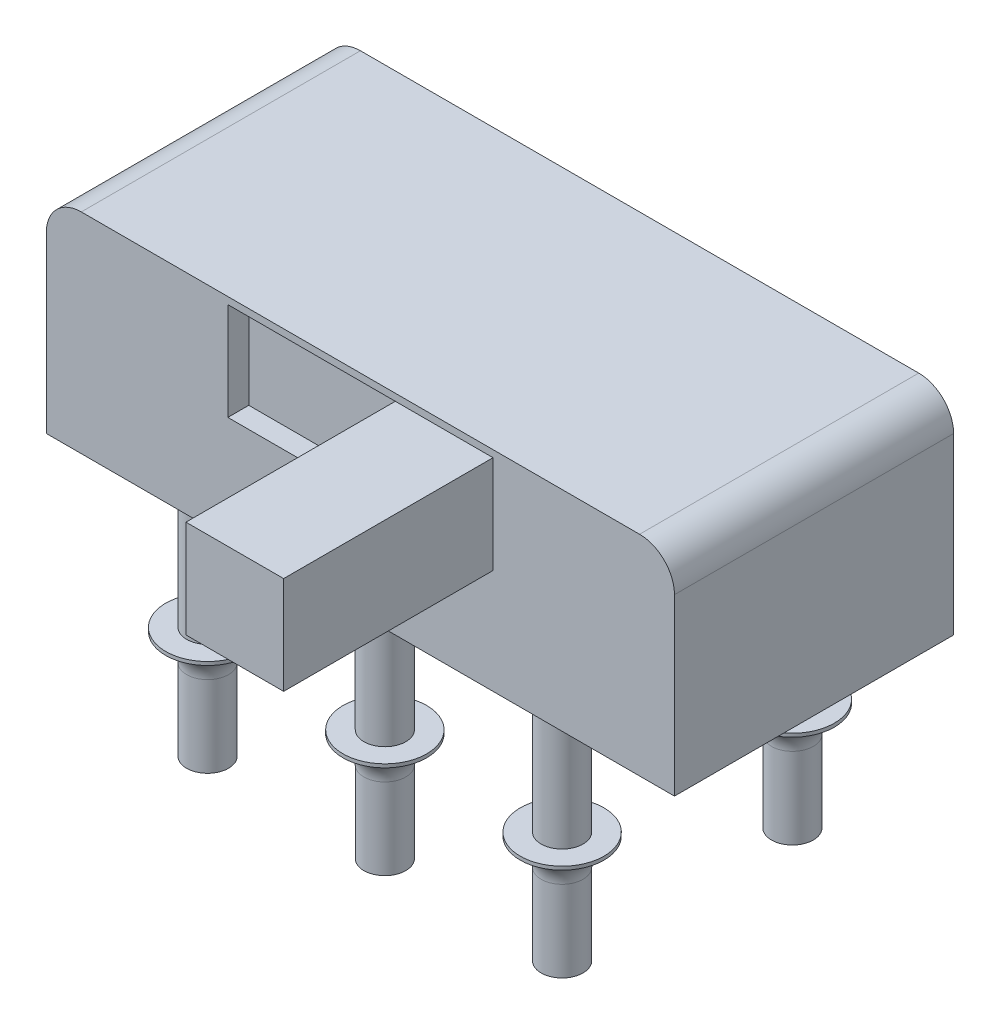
ISO-10303-21;
HEADER;
FILE_DESCRIPTION(('STEP AP214'),'2;1');
FILE_NAME('part.step','',(''),(''),'','','');
FILE_SCHEMA(('AUTOMOTIVE_DESIGN { 1 0 10303 214 1 1 1 1 }'));
ENDSEC;
DATA;
#1=APPLICATION_CONTEXT('core data for automotive mechanical design processes');
#2=APPLICATION_PROTOCOL_DEFINITION('international standard','automotive_design',2000,#1);
#3=PRODUCT_CONTEXT('',#1,'mechanical');
#4=PRODUCT('Part','Part','',(#3));
#5=PRODUCT_RELATED_PRODUCT_CATEGORY('part','',(#4));
#6=PRODUCT_DEFINITION_FORMATION('','',#4);
#7=PRODUCT_DEFINITION_CONTEXT('part definition',#1,'design');
#8=PRODUCT_DEFINITION('design','',#6,#7);
#9=PRODUCT_DEFINITION_SHAPE('','',#8);
#10=(LENGTH_UNIT() NAMED_UNIT(*) SI_UNIT(.MILLI.,.METRE.));
#11=(NAMED_UNIT(*) PLANE_ANGLE_UNIT() SI_UNIT($,.RADIAN.));
#12=(NAMED_UNIT(*) SI_UNIT($,.STERADIAN.) SOLID_ANGLE_UNIT());
#13=UNCERTAINTY_MEASURE_WITH_UNIT(LENGTH_MEASURE(1.E-05),#10,'distance_accuracy_value','');
#14=(GEOMETRIC_REPRESENTATION_CONTEXT(3) GLOBAL_UNCERTAINTY_ASSIGNED_CONTEXT((#13)) GLOBAL_UNIT_ASSIGNED_CONTEXT((#10,
#11,#12)) REPRESENTATION_CONTEXT('',''));
#15=CARTESIAN_POINT('',(0.,0.,0.));
#16=DIRECTION('',(0.,0.,1.));
#17=DIRECTION('',(1.,0.,0.));
#18=AXIS2_PLACEMENT_3D('',#15,#16,#17);
#19=CARTESIAN_POINT('',(2.54,-3.2,1.65));
#20=DIRECTION('',(0.,1.,0.));
#21=DIRECTION('',(0.,0.,1.));
#22=AXIS2_PLACEMENT_3D('',#19,#20,#21);
#23=CYLINDRICAL_SURFACE('',#22,0.3);
#24=CARTESIAN_POINT('',(2.54,0.,1.65));
#25=DIRECTION('',(0.,-1.,0.));
#26=DIRECTION('',(0.,0.,-1.));
#27=AXIS2_PLACEMENT_3D('',#24,#25,#26);
#28=CIRCLE('',#27,0.3);
#29=CARTESIAN_POINT('',(2.54,0.,1.35));
#30=VERTEX_POINT('',#29);
#31=EDGE_CURVE('E349',#30,#30,#28,.T.);
#32=ORIENTED_EDGE('',*,*,#31,.T.);
#33=EDGE_LOOP('',(#32));
#34=FACE_BOUND('',#33,.T.);
#35=CARTESIAN_POINT('',(2.54,-1.6,1.65));
#36=DIRECTION('',(0.,-1.,0.));
#37=DIRECTION('',(0.,0.,-1.));
#38=AXIS2_PLACEMENT_3D('',#35,#36,#37);
#39=CIRCLE('',#38,0.3);
#40=CARTESIAN_POINT('',(2.54,-1.6,1.35));
#41=VERTEX_POINT('',#40);
#42=EDGE_CURVE('E248',#41,#41,#39,.T.);
#43=ORIENTED_EDGE('',*,*,#42,.F.);
#44=EDGE_LOOP('',(#43));
#45=FACE_BOUND('',#44,.T.);
#46=ADVANCED_FACE('F35',(#34,#45),#23,.T.);
#47=CARTESIAN_POINT('',(2.54,-3.2,-1.65));
#48=DIRECTION('',(0.,1.,0.));
#49=DIRECTION('',(0.,0.,1.));
#50=AXIS2_PLACEMENT_3D('',#47,#48,#49);
#51=CYLINDRICAL_SURFACE('',#50,0.3);
#52=CARTESIAN_POINT('',(2.54,0.,-1.65));
#53=DIRECTION('',(0.,-1.,0.));
#54=DIRECTION('',(0.,0.,-1.));
#55=AXIS2_PLACEMENT_3D('',#52,#53,#54);
#56=CIRCLE('',#55,0.3);
#57=CARTESIAN_POINT('',(2.54,0.,-1.95));
#58=VERTEX_POINT('',#57);
#59=EDGE_CURVE('E348',#58,#58,#56,.T.);
#60=ORIENTED_EDGE('',*,*,#59,.T.);
#61=EDGE_LOOP('',(#60));
#62=FACE_BOUND('',#61,.T.);
#63=CARTESIAN_POINT('',(2.54,-1.6,-1.65));
#64=DIRECTION('',(0.,-1.,0.));
#65=DIRECTION('',(0.,0.,-1.));
#66=AXIS2_PLACEMENT_3D('',#63,#64,#65);
#67=CIRCLE('',#66,0.3);
#68=CARTESIAN_POINT('',(2.54,-1.6,-1.95));
#69=VERTEX_POINT('',#68);
#70=EDGE_CURVE('E245',#69,#69,#67,.T.);
#71=ORIENTED_EDGE('',*,*,#70,.F.);
#72=EDGE_LOOP('',(#71));
#73=FACE_BOUND('',#72,.T.);
#74=ADVANCED_FACE('F315',(#62,#73),#51,.T.);
#75=CARTESIAN_POINT('',(0.,-3.2,1.65));
#76=DIRECTION('',(0.,1.,0.));
#77=DIRECTION('',(0.,0.,1.));
#78=AXIS2_PLACEMENT_3D('',#75,#76,#77);
#79=CYLINDRICAL_SURFACE('',#78,0.3);
#80=CARTESIAN_POINT('',(0.,0.,1.65));
#81=DIRECTION('',(0.,-1.,0.));
#82=DIRECTION('',(0.,0.,-1.));
#83=AXIS2_PLACEMENT_3D('',#80,#81,#82);
#84=CIRCLE('',#83,0.3);
#85=CARTESIAN_POINT('',(0.,0.,1.35));
#86=VERTEX_POINT('',#85);
#87=EDGE_CURVE('E361',#86,#86,#84,.T.);
#88=ORIENTED_EDGE('',*,*,#87,.T.);
#89=EDGE_LOOP('',(#88));
#90=FACE_BOUND('',#89,.T.);
#91=CARTESIAN_POINT('',(0.,-1.6,1.65));
#92=DIRECTION('',(0.,-1.,0.));
#93=DIRECTION('',(0.,0.,-1.));
#94=AXIS2_PLACEMENT_3D('',#91,#92,#93);
#95=CIRCLE('',#94,0.3);
#96=CARTESIAN_POINT('',(0.,-1.6,1.35));
#97=VERTEX_POINT('',#96);
#98=EDGE_CURVE('E242',#97,#97,#95,.T.);
#99=ORIENTED_EDGE('',*,*,#98,.F.);
#100=EDGE_LOOP('',(#99));
#101=FACE_BOUND('',#100,.T.);
#102=ADVANCED_FACE('F322',(#90,#101),#79,.T.);
#103=CARTESIAN_POINT('',(0.,-3.2,-1.65));
#104=DIRECTION('',(0.,1.,0.));
#105=DIRECTION('',(0.,0.,1.));
#106=AXIS2_PLACEMENT_3D('',#103,#104,#105);
#107=CYLINDRICAL_SURFACE('',#106,0.3);
#108=CARTESIAN_POINT('',(0.,0.,-1.65));
#109=DIRECTION('',(0.,-1.,0.));
#110=DIRECTION('',(0.,0.,-1.));
#111=AXIS2_PLACEMENT_3D('',#108,#109,#110);
#112=CIRCLE('',#111,0.3);
#113=CARTESIAN_POINT('',(0.,0.,-1.95));
#114=VERTEX_POINT('',#113);
#115=EDGE_CURVE('E366',#114,#114,#112,.T.);
#116=ORIENTED_EDGE('',*,*,#115,.T.);
#117=EDGE_LOOP('',(#116));
#118=FACE_BOUND('',#117,.T.);
#119=CARTESIAN_POINT('',(0.,-1.6,-1.65));
#120=DIRECTION('',(0.,-1.,0.));
#121=DIRECTION('',(0.,0.,-1.));
#122=AXIS2_PLACEMENT_3D('',#119,#120,#121);
#123=CIRCLE('',#122,0.3);
#124=CARTESIAN_POINT('',(0.,-1.6,-1.95));
#125=VERTEX_POINT('',#124);
#126=EDGE_CURVE('E239',#125,#125,#123,.T.);
#127=ORIENTED_EDGE('',*,*,#126,.F.);
#128=EDGE_LOOP('',(#127));
#129=FACE_BOUND('',#128,.T.);
#130=ADVANCED_FACE('F403',(#118,#129),#107,.T.);
#131=CARTESIAN_POINT('',(-2.54,-3.2,1.65));
#132=DIRECTION('',(0.,1.,0.));
#133=DIRECTION('',(0.,0.,1.));
#134=AXIS2_PLACEMENT_3D('',#131,#132,#133);
#135=CYLINDRICAL_SURFACE('',#134,0.3);
#136=CARTESIAN_POINT('',(-2.54,0.,1.65));
#137=DIRECTION('',(0.,-1.,0.));
#138=DIRECTION('',(0.,0.,-1.));
#139=AXIS2_PLACEMENT_3D('',#136,#137,#138);
#140=CIRCLE('',#139,0.3);
#141=CARTESIAN_POINT('',(-2.54,0.,1.35));
#142=VERTEX_POINT('',#141);
#143=EDGE_CURVE('E372',#142,#142,#140,.T.);
#144=ORIENTED_EDGE('',*,*,#143,.T.);
#145=EDGE_LOOP('',(#144));
#146=FACE_BOUND('',#145,.T.);
#147=CARTESIAN_POINT('',(-2.54,-1.6,1.65));
#148=DIRECTION('',(0.,-1.,0.));
#149=DIRECTION('',(0.,0.,-1.));
#150=AXIS2_PLACEMENT_3D('',#147,#148,#149);
#151=CIRCLE('',#150,0.3);
#152=CARTESIAN_POINT('',(-2.54,-1.6,1.35));
#153=VERTEX_POINT('',#152);
#154=EDGE_CURVE('E236',#153,#153,#151,.T.);
#155=ORIENTED_EDGE('',*,*,#154,.F.);
#156=EDGE_LOOP('',(#155));
#157=FACE_BOUND('',#156,.T.);
#158=ADVANCED_FACE('F394',(#146,#157),#135,.T.);
#159=CARTESIAN_POINT('',(0.,0.,0.));
#160=DIRECTION('',(0.,-1.,0.));
#161=DIRECTION('',(0.,0.,-1.));
#162=AXIS2_PLACEMENT_3D('',#159,#160,#161);
#163=PLANE('',#162);
#164=ORIENTED_EDGE('',*,*,#59,.F.);
#165=EDGE_LOOP('',(#164));
#166=FACE_BOUND('',#165,.T.);
#167=ORIENTED_EDGE('',*,*,#115,.F.);
#168=EDGE_LOOP('',(#167));
#169=FACE_BOUND('',#168,.T.);
#170=CARTESIAN_POINT('',(-2.54,0.,-1.65));
#171=DIRECTION('',(0.,-1.,0.));
#172=DIRECTION('',(0.,0.,-1.));
#173=AXIS2_PLACEMENT_3D('',#170,#171,#172);
#174=CIRCLE('',#173,0.3);
#175=CARTESIAN_POINT('',(-2.54,0.,-1.95));
#176=VERTEX_POINT('',#175);
#177=EDGE_CURVE('E161',#176,#176,#174,.T.);
#178=ORIENTED_EDGE('',*,*,#177,.F.);
#179=EDGE_LOOP('',(#178));
#180=FACE_BOUND('',#179,.T.);
#181=DIRECTION('',(0.,0.,-1.));
#182=VECTOR('',#181,1.);
#183=CARTESIAN_POINT('',(4.5,0.,2.));
#184=LINE('',#183,#182);
#185=CARTESIAN_POINT('',(4.5,0.,2.));
#186=VERTEX_POINT('',#185);
#187=CARTESIAN_POINT('',(4.5,0.,-2.));
#188=VERTEX_POINT('',#187);
#189=EDGE_CURVE('E204',#186,#188,#184,.T.);
#190=ORIENTED_EDGE('',*,*,#189,.F.);
#191=DIRECTION('',(1.,0.,0.));
#192=VECTOR('',#191,1.);
#193=CARTESIAN_POINT('',(-4.5,0.,2.));
#194=LINE('',#193,#192);
#195=CARTESIAN_POINT('',(-4.5,0.,2.));
#196=VERTEX_POINT('',#195);
#197=EDGE_CURVE('E209',#196,#186,#194,.T.);
#198=ORIENTED_EDGE('',*,*,#197,.F.);
#199=DIRECTION('',(0.,0.,1.));
#200=VECTOR('',#199,1.);
#201=CARTESIAN_POINT('',(-4.5,0.,2.));
#202=LINE('',#201,#200);
#203=CARTESIAN_POINT('',(-4.5,0.,-2.));
#204=VERTEX_POINT('',#203);
#205=EDGE_CURVE('E218',#204,#196,#202,.T.);
#206=ORIENTED_EDGE('',*,*,#205,.F.);
#207=DIRECTION('',(-1.,0.,0.));
#208=VECTOR('',#207,1.);
#209=CARTESIAN_POINT('',(-4.5,0.,-2.));
#210=LINE('',#209,#208);
#211=EDGE_CURVE('E215',#188,#204,#210,.T.);
#212=ORIENTED_EDGE('',*,*,#211,.F.);
#213=EDGE_LOOP('',(#190,#198,#206,#212));
#214=FACE_BOUND('',#213,.T.);
#215=ORIENTED_EDGE('',*,*,#143,.F.);
#216=EDGE_LOOP('',(#215));
#217=FACE_BOUND('',#216,.T.);
#218=ORIENTED_EDGE('',*,*,#87,.F.);
#219=EDGE_LOOP('',(#218));
#220=FACE_BOUND('',#219,.T.);
#221=ORIENTED_EDGE('',*,*,#31,.F.);
#222=EDGE_LOOP('',(#221));
#223=FACE_BOUND('',#222,.T.);
#224=ADVANCED_FACE('F295',(#166,#169,#180,#214,#217,#220,#223),#163,.T.);
#225=CARTESIAN_POINT('',(-2.54,-3.2,-1.65));
#226=DIRECTION('',(0.,1.,0.));
#227=DIRECTION('',(0.,0.,1.));
#228=AXIS2_PLACEMENT_3D('',#225,#226,#227);
#229=CYLINDRICAL_SURFACE('',#228,0.3);
#230=ORIENTED_EDGE('',*,*,#177,.T.);
#231=EDGE_LOOP('',(#230));
#232=FACE_BOUND('',#231,.T.);
#233=CARTESIAN_POINT('',(-2.54,-1.6,-1.65));
#234=DIRECTION('',(0.,-1.,0.));
#235=DIRECTION('',(0.,0.,-1.));
#236=AXIS2_PLACEMENT_3D('',#233,#234,#235);
#237=CIRCLE('',#236,0.3);
#238=CARTESIAN_POINT('',(-2.54,-1.6,-1.95));
#239=VERTEX_POINT('',#238);
#240=EDGE_CURVE('E230',#239,#239,#237,.T.);
#241=ORIENTED_EDGE('',*,*,#240,.F.);
#242=EDGE_LOOP('',(#241));
#243=FACE_BOUND('',#242,.T.);
#244=ADVANCED_FACE('F311',(#232,#243),#229,.T.);
#245=CARTESIAN_POINT('',(-4.5,3.,2.));
#246=DIRECTION('',(0.,0.,-1.));
#247=DIRECTION('',(-1.,0.,0.));
#248=AXIS2_PLACEMENT_3D('',#245,#246,#247);
#249=PLANE('',#248);
#250=DIRECTION('',(1.,0.,0.));
#251=VECTOR('',#250,1.);
#252=CARTESIAN_POINT('',(-4.5,3.,2.));
#253=LINE('',#252,#251);
#254=CARTESIAN_POINT('',(-4.,3.,2.));
#255=VERTEX_POINT('',#254);
#256=CARTESIAN_POINT('',(4.,3.,2.));
#257=VERTEX_POINT('',#256);
#258=EDGE_CURVE('E208',#255,#257,#253,.T.);
#259=ORIENTED_EDGE('',*,*,#258,.F.);
#260=CARTESIAN_POINT('',(-4.,2.5,2.));
#261=DIRECTION('',(0.,0.,-1.));
#262=DIRECTION('',(-1.,0.,0.));
#263=AXIS2_PLACEMENT_3D('',#260,#261,#262);
#264=CIRCLE('',#263,0.5);
#265=CARTESIAN_POINT('',(-4.5,2.5,2.));
#266=VERTEX_POINT('',#265);
#267=EDGE_CURVE('E274',#255,#266,#264,.F.);
#268=ORIENTED_EDGE('',*,*,#267,.T.);
#269=DIRECTION('',(0.,-1.,0.));
#270=VECTOR('',#269,1.);
#271=CARTESIAN_POINT('',(-4.5,3.,2.));
#272=LINE('',#271,#270);
#273=EDGE_CURVE('E224',#266,#196,#272,.T.);
#274=ORIENTED_EDGE('',*,*,#273,.T.);
#275=ORIENTED_EDGE('',*,*,#197,.T.);
#276=DIRECTION('',(0.,-1.,0.));
#277=VECTOR('',#276,1.);
#278=CARTESIAN_POINT('',(4.5,3.,2.));
#279=LINE('',#278,#277);
#280=CARTESIAN_POINT('',(4.5,2.5,2.));
#281=VERTEX_POINT('',#280);
#282=EDGE_CURVE('E212',#281,#186,#279,.T.);
#283=ORIENTED_EDGE('',*,*,#282,.F.);
#284=CARTESIAN_POINT('',(4.,2.5,2.));
#285=DIRECTION('',(0.,0.,-1.));
#286=DIRECTION('',(-1.,0.,0.));
#287=AXIS2_PLACEMENT_3D('',#284,#285,#286);
#288=CIRCLE('',#287,0.5);
#289=EDGE_CURVE('E272',#281,#257,#288,.F.);
#290=ORIENTED_EDGE('',*,*,#289,.T.);
#291=EDGE_LOOP('',(#259,#268,#274,#275,#283,#290));
#292=FACE_BOUND('',#291,.T.);
#293=DIRECTION('',(1.,0.,0.));
#294=VECTOR('',#293,1.);
#295=CARTESIAN_POINT('',(1.9,1.5,2.));
#296=LINE('',#295,#294);
#297=CARTESIAN_POINT('',(0.5,1.5,2.));
#298=VERTEX_POINT('',#297);
#299=CARTESIAN_POINT('',(1.9,1.5,2.));
#300=VERTEX_POINT('',#299);
#301=EDGE_CURVE('E181',#298,#300,#296,.T.);
#302=ORIENTED_EDGE('',*,*,#301,.F.);
#303=DIRECTION('',(1.,0.,0.));
#304=VECTOR('',#303,1.);
#305=CARTESIAN_POINT('',(0.5,1.5,2.));
#306=LINE('',#305,#304);
#307=CARTESIAN_POINT('',(-1.9,1.5,2.));
#308=VERTEX_POINT('',#307);
#309=EDGE_CURVE('E156',#308,#298,#306,.T.);
#310=ORIENTED_EDGE('',*,*,#309,.F.);
#311=DIRECTION('',(0.,-1.,0.));
#312=VECTOR('',#311,1.);
#313=CARTESIAN_POINT('',(-1.9,2.9,2.));
#314=LINE('',#313,#312);
#315=CARTESIAN_POINT('',(-1.9,2.9,2.));
#316=VERTEX_POINT('',#315);
#317=EDGE_CURVE('E158',#316,#308,#314,.T.);
#318=ORIENTED_EDGE('',*,*,#317,.F.);
#319=DIRECTION('',(-1.,0.,0.));
#320=VECTOR('',#319,1.);
#321=CARTESIAN_POINT('',(0.5,2.9,2.));
#322=LINE('',#321,#320);
#323=CARTESIAN_POINT('',(0.5,2.9,2.));
#324=VERTEX_POINT('',#323);
#325=EDGE_CURVE('E166',#324,#316,#322,.T.);
#326=ORIENTED_EDGE('',*,*,#325,.F.);
#327=DIRECTION('',(-1.,0.,0.));
#328=VECTOR('',#327,1.);
#329=CARTESIAN_POINT('',(1.9,2.9,2.));
#330=LINE('',#329,#328);
#331=CARTESIAN_POINT('',(1.9,2.9,2.));
#332=VERTEX_POINT('',#331);
#333=EDGE_CURVE('E190',#332,#324,#330,.T.);
#334=ORIENTED_EDGE('',*,*,#333,.F.);
#335=DIRECTION('',(0.,1.,0.));
#336=VECTOR('',#335,1.);
#337=CARTESIAN_POINT('',(1.9,2.9,2.));
#338=LINE('',#337,#336);
#339=EDGE_CURVE('E173',#300,#332,#338,.T.);
#340=ORIENTED_EDGE('',*,*,#339,.F.);
#341=EDGE_LOOP('',(#302,#310,#318,#326,#334,#340));
#342=FACE_BOUND('',#341,.T.);
#343=ADVANCED_FACE('F287',(#292,#342),#249,.F.);
#344=CARTESIAN_POINT('',(4.5,3.,2.));
#345=DIRECTION('',(-1.,0.,0.));
#346=DIRECTION('',(0.,0.,1.));
#347=AXIS2_PLACEMENT_3D('',#344,#345,#346);
#348=PLANE('',#347);
#349=DIRECTION('',(0.,-1.,0.));
#350=VECTOR('',#349,1.);
#351=CARTESIAN_POINT('',(4.5,3.,-2.));
#352=LINE('',#351,#350);
#353=CARTESIAN_POINT('',(4.5,2.5,-2.));
#354=VERTEX_POINT('',#353);
#355=EDGE_CURVE('E228',#354,#188,#352,.T.);
#356=ORIENTED_EDGE('',*,*,#355,.F.);
#357=DIRECTION('',(0.,0.,-1.));
#358=VECTOR('',#357,1.);
#359=CARTESIAN_POINT('',(4.5,2.5,2.));
#360=LINE('',#359,#358);
#361=EDGE_CURVE('E11',#354,#281,#360,.F.);
#362=ORIENTED_EDGE('',*,*,#361,.T.);
#363=ORIENTED_EDGE('',*,*,#282,.T.);
#364=ORIENTED_EDGE('',*,*,#189,.T.);
#365=EDGE_LOOP('',(#356,#362,#363,#364));
#366=FACE_BOUND('',#365,.T.);
#367=ADVANCED_FACE('F302',(#366),#348,.F.);
#368=CARTESIAN_POINT('',(-4.5,3.,-2.));
#369=DIRECTION('',(0.,0.,1.));
#370=DIRECTION('',(1.,0.,0.));
#371=AXIS2_PLACEMENT_3D('',#368,#369,#370);
#372=PLANE('',#371);
#373=DIRECTION('',(0.,-1.,0.));
#374=VECTOR('',#373,1.);
#375=CARTESIAN_POINT('',(-4.5,3.,-2.));
#376=LINE('',#375,#374);
#377=CARTESIAN_POINT('',(-4.5,2.5,-2.));
#378=VERTEX_POINT('',#377);
#379=EDGE_CURVE('E226',#378,#204,#376,.T.);
#380=ORIENTED_EDGE('',*,*,#379,.F.);
#381=CARTESIAN_POINT('',(-4.,2.5,-2.));
#382=DIRECTION('',(0.,0.,1.));
#383=DIRECTION('',(1.,0.,0.));
#384=AXIS2_PLACEMENT_3D('',#381,#382,#383);
#385=CIRCLE('',#384,0.5);
#386=CARTESIAN_POINT('',(-4.,3.,-2.));
#387=VERTEX_POINT('',#386);
#388=EDGE_CURVE('E43',#378,#387,#385,.F.);
#389=ORIENTED_EDGE('',*,*,#388,.T.);
#390=DIRECTION('',(-1.,0.,0.));
#391=VECTOR('',#390,1.);
#392=CARTESIAN_POINT('',(-4.5,3.,-2.));
#393=LINE('',#392,#391);
#394=CARTESIAN_POINT('',(4.,3.,-2.));
#395=VERTEX_POINT('',#394);
#396=EDGE_CURVE('E205',#395,#387,#393,.T.);
#397=ORIENTED_EDGE('',*,*,#396,.F.);
#398=CARTESIAN_POINT('',(4.,2.5,-2.));
#399=DIRECTION('',(0.,0.,1.));
#400=DIRECTION('',(1.,0.,0.));
#401=AXIS2_PLACEMENT_3D('',#398,#399,#400);
#402=CIRCLE('',#401,0.5);
#403=EDGE_CURVE('E50',#395,#354,#402,.F.);
#404=ORIENTED_EDGE('',*,*,#403,.T.);
#405=ORIENTED_EDGE('',*,*,#355,.T.);
#406=ORIENTED_EDGE('',*,*,#211,.T.);
#407=EDGE_LOOP('',(#380,#389,#397,#404,#405,#406));
#408=FACE_BOUND('',#407,.T.);
#409=ADVANCED_FACE('F278',(#408),#372,.F.);
#410=CARTESIAN_POINT('',(-4.5,3.,2.));
#411=DIRECTION('',(1.,0.,0.));
#412=DIRECTION('',(0.,0.,-1.));
#413=AXIS2_PLACEMENT_3D('',#410,#411,#412);
#414=PLANE('',#413);
#415=ORIENTED_EDGE('',*,*,#273,.F.);
#416=DIRECTION('',(0.,0.,1.));
#417=VECTOR('',#416,1.);
#418=CARTESIAN_POINT('',(-4.5,2.5,2.));
#419=LINE('',#418,#417);
#420=EDGE_CURVE('E58',#266,#378,#419,.F.);
#421=ORIENTED_EDGE('',*,*,#420,.T.);
#422=ORIENTED_EDGE('',*,*,#379,.T.);
#423=ORIENTED_EDGE('',*,*,#205,.T.);
#424=EDGE_LOOP('',(#415,#421,#422,#423));
#425=FACE_BOUND('',#424,.T.);
#426=ADVANCED_FACE('F289',(#425),#414,.F.);
#427=CARTESIAN_POINT('',(0.,3.,0.));
#428=DIRECTION('',(0.,-1.,0.));
#429=DIRECTION('',(0.,0.,-1.));
#430=AXIS2_PLACEMENT_3D('',#427,#428,#429);
#431=PLANE('',#430);
#432=ORIENTED_EDGE('',*,*,#396,.T.);
#433=DIRECTION('',(0.,0.,1.));
#434=VECTOR('',#433,1.);
#435=CARTESIAN_POINT('',(-4.,3.,0.));
#436=LINE('',#435,#434);
#437=EDGE_CURVE('E269',#387,#255,#436,.T.);
#438=ORIENTED_EDGE('',*,*,#437,.T.);
#439=ORIENTED_EDGE('',*,*,#258,.T.);
#440=DIRECTION('',(0.,0.,-1.));
#441=VECTOR('',#440,1.);
#442=CARTESIAN_POINT('',(4.,3.,0.));
#443=LINE('',#442,#441);
#444=EDGE_CURVE('E266',#257,#395,#443,.T.);
#445=ORIENTED_EDGE('',*,*,#444,.T.);
#446=EDGE_LOOP('',(#432,#438,#439,#445));
#447=FACE_BOUND('',#446,.T.);
#448=ADVANCED_FACE('F282',(#447),#431,.F.);
#449=CARTESIAN_POINT('',(1.9,2.9,5.));
#450=DIRECTION('',(-1.,0.,0.));
#451=DIRECTION('',(0.,0.,1.));
#452=AXIS2_PLACEMENT_3D('',#449,#450,#451);
#453=PLANE('',#452);
#454=ORIENTED_EDGE('',*,*,#339,.T.);
#455=DIRECTION('',(0.,0.,-1.));
#456=VECTOR('',#455,1.);
#457=CARTESIAN_POINT('',(1.9,2.9,5.));
#458=LINE('',#457,#456);
#459=CARTESIAN_POINT('',(1.9,2.9,5.));
#460=VERTEX_POINT('',#459);
#461=EDGE_CURVE('E201',#460,#332,#458,.T.);
#462=ORIENTED_EDGE('',*,*,#461,.F.);
#463=DIRECTION('',(0.,1.,0.));
#464=VECTOR('',#463,1.);
#465=CARTESIAN_POINT('',(1.9,2.9,5.));
#466=LINE('',#465,#464);
#467=CARTESIAN_POINT('',(1.9,1.5,5.));
#468=VERTEX_POINT('',#467);
#469=EDGE_CURVE('E177',#468,#460,#466,.T.);
#470=ORIENTED_EDGE('',*,*,#469,.F.);
#471=DIRECTION('',(0.,0.,-1.));
#472=VECTOR('',#471,1.);
#473=CARTESIAN_POINT('',(1.9,1.5,5.));
#474=LINE('',#473,#472);
#475=EDGE_CURVE('E187',#468,#300,#474,.T.);
#476=ORIENTED_EDGE('',*,*,#475,.T.);
#477=EDGE_LOOP('',(#454,#462,#470,#476));
#478=FACE_BOUND('',#477,.T.);
#479=ADVANCED_FACE('F415',(#478),#453,.F.);
#480=CARTESIAN_POINT('',(1.9,2.9,5.));
#481=DIRECTION('',(0.,-1.,0.));
#482=DIRECTION('',(1.,0.,0.));
#483=AXIS2_PLACEMENT_3D('',#480,#481,#482);
#484=PLANE('',#483);
#485=ORIENTED_EDGE('',*,*,#333,.T.);
#486=DIRECTION('',(0.,0.,-1.));
#487=VECTOR('',#486,1.);
#488=CARTESIAN_POINT('',(0.5,2.9,5.));
#489=LINE('',#488,#487);
#490=CARTESIAN_POINT('',(0.5,2.9,5.));
#491=VERTEX_POINT('',#490);
#492=EDGE_CURVE('E139',#491,#324,#489,.T.);
#493=ORIENTED_EDGE('',*,*,#492,.F.);
#494=DIRECTION('',(-1.,0.,0.));
#495=VECTOR('',#494,1.);
#496=CARTESIAN_POINT('',(1.9,2.9,5.));
#497=LINE('',#496,#495);
#498=EDGE_CURVE('E180',#460,#491,#497,.T.);
#499=ORIENTED_EDGE('',*,*,#498,.F.);
#500=ORIENTED_EDGE('',*,*,#461,.T.);
#501=EDGE_LOOP('',(#485,#493,#499,#500));
#502=FACE_BOUND('',#501,.T.);
#503=ADVANCED_FACE('F420',(#502),#484,.F.);
#504=CARTESIAN_POINT('',(0.5,2.9,5.));
#505=DIRECTION('',(1.,0.,0.));
#506=DIRECTION('',(0.,1.,0.));
#507=AXIS2_PLACEMENT_3D('',#504,#505,#506);
#508=PLANE('',#507);
#509=ORIENTED_EDGE('',*,*,#492,.T.);
#510=DIRECTION('',(0.,0.,1.));
#511=VECTOR('',#510,1.);
#512=CARTESIAN_POINT('',(0.5,2.9,1.7));
#513=LINE('',#512,#511);
#514=CARTESIAN_POINT('',(0.5,2.9,1.7));
#515=VERTEX_POINT('',#514);
#516=EDGE_CURVE('E130',#515,#324,#513,.T.);
#517=ORIENTED_EDGE('',*,*,#516,.F.);
#518=DIRECTION('',(0.,1.,0.));
#519=VECTOR('',#518,1.);
#520=CARTESIAN_POINT('',(0.5,2.9,1.7));
#521=LINE('',#520,#519);
#522=CARTESIAN_POINT('',(0.5,1.5,1.7));
#523=VERTEX_POINT('',#522);
#524=EDGE_CURVE('E135',#523,#515,#521,.T.);
#525=ORIENTED_EDGE('',*,*,#524,.F.);
#526=DIRECTION('',(0.,0.,1.));
#527=VECTOR('',#526,1.);
#528=CARTESIAN_POINT('',(0.5,1.5,1.7));
#529=LINE('',#528,#527);
#530=EDGE_CURVE('E171',#523,#298,#529,.T.);
#531=ORIENTED_EDGE('',*,*,#530,.T.);
#532=DIRECTION('',(0.,0.,-1.));
#533=VECTOR('',#532,1.);
#534=CARTESIAN_POINT('',(0.5,1.5,5.));
#535=LINE('',#534,#533);
#536=CARTESIAN_POINT('',(0.5,1.5,5.));
#537=VERTEX_POINT('',#536);
#538=EDGE_CURVE('E197',#537,#298,#535,.T.);
#539=ORIENTED_EDGE('',*,*,#538,.F.);
#540=DIRECTION('',(0.,-1.,0.));
#541=VECTOR('',#540,1.);
#542=CARTESIAN_POINT('',(0.5,2.9,5.));
#543=LINE('',#542,#541);
#544=EDGE_CURVE('E183',#491,#537,#543,.T.);
#545=ORIENTED_EDGE('',*,*,#544,.F.);
#546=EDGE_LOOP('',(#509,#517,#525,#531,#539,#545));
#547=FACE_BOUND('',#546,.T.);
#548=ADVANCED_FACE('F132',(#547),#508,.F.);
#549=CARTESIAN_POINT('',(1.9,1.5,5.));
#550=DIRECTION('',(0.,1.,0.));
#551=DIRECTION('',(-1.,0.,0.));
#552=AXIS2_PLACEMENT_3D('',#549,#550,#551);
#553=PLANE('',#552);
#554=ORIENTED_EDGE('',*,*,#301,.T.);
#555=ORIENTED_EDGE('',*,*,#475,.F.);
#556=DIRECTION('',(1.,0.,0.));
#557=VECTOR('',#556,1.);
#558=CARTESIAN_POINT('',(1.9,1.5,5.));
#559=LINE('',#558,#557);
#560=EDGE_CURVE('E185',#537,#468,#559,.T.);
#561=ORIENTED_EDGE('',*,*,#560,.F.);
#562=ORIENTED_EDGE('',*,*,#538,.T.);
#563=EDGE_LOOP('',(#554,#555,#561,#562));
#564=FACE_BOUND('',#563,.T.);
#565=ADVANCED_FACE('F431',(#564),#553,.F.);
#566=CARTESIAN_POINT('',(0.,0.,5.));
#567=DIRECTION('',(0.,0.,-1.));
#568=DIRECTION('',(-1.,0.,0.));
#569=AXIS2_PLACEMENT_3D('',#566,#567,#568);
#570=PLANE('',#569);
#571=ORIENTED_EDGE('',*,*,#469,.T.);
#572=ORIENTED_EDGE('',*,*,#498,.T.);
#573=ORIENTED_EDGE('',*,*,#544,.T.);
#574=ORIENTED_EDGE('',*,*,#560,.T.);
#575=EDGE_LOOP('',(#571,#572,#573,#574));
#576=FACE_BOUND('',#575,.T.);
#577=ADVANCED_FACE('F434',(#576),#570,.F.);
#578=CARTESIAN_POINT('',(0.5,1.5,1.7));
#579=DIRECTION('',(0.,-1.,0.));
#580=DIRECTION('',(0.,0.,-1.));
#581=AXIS2_PLACEMENT_3D('',#578,#579,#580);
#582=PLANE('',#581);
#583=ORIENTED_EDGE('',*,*,#309,.T.);
#584=ORIENTED_EDGE('',*,*,#530,.F.);
#585=DIRECTION('',(1.,0.,0.));
#586=VECTOR('',#585,1.);
#587=CARTESIAN_POINT('',(0.5,1.5,1.7));
#588=LINE('',#587,#586);
#589=CARTESIAN_POINT('',(-1.9,1.5,1.7));
#590=VERTEX_POINT('',#589);
#591=EDGE_CURVE('E144',#590,#523,#588,.T.);
#592=ORIENTED_EDGE('',*,*,#591,.F.);
#593=DIRECTION('',(0.,0.,1.));
#594=VECTOR('',#593,1.);
#595=CARTESIAN_POINT('',(-1.9,1.5,1.7));
#596=LINE('',#595,#594);
#597=EDGE_CURVE('E174',#590,#308,#596,.T.);
#598=ORIENTED_EDGE('',*,*,#597,.T.);
#599=EDGE_LOOP('',(#583,#584,#592,#598));
#600=FACE_BOUND('',#599,.T.);
#601=ADVANCED_FACE('F438',(#600),#582,.F.);
#602=CARTESIAN_POINT('',(-1.9,2.9,1.7));
#603=DIRECTION('',(-1.,0.,0.));
#604=DIRECTION('',(0.,-1.,0.));
#605=AXIS2_PLACEMENT_3D('',#602,#603,#604);
#606=PLANE('',#605);
#607=ORIENTED_EDGE('',*,*,#317,.T.);
#608=ORIENTED_EDGE('',*,*,#597,.F.);
#609=DIRECTION('',(0.,-1.,0.));
#610=VECTOR('',#609,1.);
#611=CARTESIAN_POINT('',(-1.9,2.9,1.7));
#612=LINE('',#611,#610);
#613=CARTESIAN_POINT('',(-1.9,2.9,1.7));
#614=VERTEX_POINT('',#613);
#615=EDGE_CURVE('E152',#614,#590,#612,.T.);
#616=ORIENTED_EDGE('',*,*,#615,.F.);
#617=DIRECTION('',(0.,0.,1.));
#618=VECTOR('',#617,1.);
#619=CARTESIAN_POINT('',(-1.9,2.9,1.7));
#620=LINE('',#619,#618);
#621=EDGE_CURVE('E143',#614,#316,#620,.T.);
#622=ORIENTED_EDGE('',*,*,#621,.T.);
#623=EDGE_LOOP('',(#607,#608,#616,#622));
#624=FACE_BOUND('',#623,.T.);
#625=ADVANCED_FACE('F442',(#624),#606,.F.);
#626=CARTESIAN_POINT('',(0.5,2.9,1.7));
#627=DIRECTION('',(0.,1.,0.));
#628=DIRECTION('',(-1.,0.,0.));
#629=AXIS2_PLACEMENT_3D('',#626,#627,#628);
#630=PLANE('',#629);
#631=ORIENTED_EDGE('',*,*,#325,.T.);
#632=ORIENTED_EDGE('',*,*,#621,.F.);
#633=DIRECTION('',(-1.,0.,0.));
#634=VECTOR('',#633,1.);
#635=CARTESIAN_POINT('',(0.5,2.9,1.7));
#636=LINE('',#635,#634);
#637=EDGE_CURVE('E147',#515,#614,#636,.T.);
#638=ORIENTED_EDGE('',*,*,#637,.F.);
#639=ORIENTED_EDGE('',*,*,#516,.T.);
#640=EDGE_LOOP('',(#631,#632,#638,#639));
#641=FACE_BOUND('',#640,.T.);
#642=ADVANCED_FACE('F148',(#641),#630,.F.);
#643=CARTESIAN_POINT('',(0.,0.,1.7));
#644=DIRECTION('',(0.,0.,-1.));
#645=DIRECTION('',(-1.,0.,0.));
#646=AXIS2_PLACEMENT_3D('',#643,#644,#645);
#647=PLANE('',#646);
#648=ORIENTED_EDGE('',*,*,#524,.T.);
#649=ORIENTED_EDGE('',*,*,#637,.T.);
#650=ORIENTED_EDGE('',*,*,#615,.T.);
#651=ORIENTED_EDGE('',*,*,#591,.T.);
#652=EDGE_LOOP('',(#648,#649,#650,#651));
#653=FACE_BOUND('',#652,.T.);
#654=ADVANCED_FACE('F154',(#653),#647,.F.);
#655=CARTESIAN_POINT('',(-2.54,-1.6,-1.65));
#656=DIRECTION('',(0.,-1.,0.));
#657=DIRECTION('',(0.,0.,-1.));
#658=AXIS2_PLACEMENT_3D('',#655,#656,#657);
#659=PLANE('',#658);
#660=CARTESIAN_POINT('',(-2.54,-1.6,-1.65));
#661=DIRECTION('',(0.,-1.,0.));
#662=DIRECTION('',(0.,0.,-1.));
#663=AXIS2_PLACEMENT_3D('',#660,#661,#662);
#664=CIRCLE('',#663,0.6);
#665=CARTESIAN_POINT('',(-2.54,-1.6,-2.25));
#666=VERTEX_POINT('',#665);
#667=EDGE_CURVE('E378',#666,#666,#664,.T.);
#668=ORIENTED_EDGE('',*,*,#667,.F.);
#669=EDGE_LOOP('',(#668));
#670=FACE_BOUND('',#669,.T.);
#671=ORIENTED_EDGE('',*,*,#240,.T.);
#672=EDGE_LOOP('',(#671));
#673=FACE_BOUND('',#672,.T.);
#674=ADVANCED_FACE('F450',(#670,#673),#659,.F.);
#675=CARTESIAN_POINT('',(-2.54,-1.65,-1.65));
#676=DIRECTION('',(0.,1.,0.));
#677=DIRECTION('',(0.,0.,1.));
#678=AXIS2_PLACEMENT_3D('',#675,#676,#677);
#679=CYLINDRICAL_SURFACE('',#678,0.6);
#680=CARTESIAN_POINT('',(-2.54,-1.65,-1.65));
#681=DIRECTION('',(0.,-1.,0.));
#682=DIRECTION('',(0.,0.,-1.));
#683=AXIS2_PLACEMENT_3D('',#680,#681,#682);
#684=CIRCLE('',#683,0.6);
#685=CARTESIAN_POINT('',(-2.54,-1.65,-2.25));
#686=VERTEX_POINT('',#685);
#687=EDGE_CURVE('E381',#686,#686,#684,.T.);
#688=ORIENTED_EDGE('',*,*,#687,.F.);
#689=EDGE_LOOP('',(#688));
#690=FACE_BOUND('',#689,.T.);
#691=ORIENTED_EDGE('',*,*,#667,.T.);
#692=EDGE_LOOP('',(#691));
#693=FACE_BOUND('',#692,.T.);
#694=ADVANCED_FACE('F458',(#690,#693),#679,.T.);
#695=CARTESIAN_POINT('',(-2.54,-3.2,-1.65));
#696=DIRECTION('',(0.,-1.,0.));
#697=DIRECTION('',(0.,0.,-1.));
#698=AXIS2_PLACEMENT_3D('',#695,#696,#697);
#699=PLANE('',#698);
#700=CARTESIAN_POINT('',(-2.54,-3.2,-1.65));
#701=DIRECTION('',(0.,-1.,0.));
#702=DIRECTION('',(0.,0.,-1.));
#703=AXIS2_PLACEMENT_3D('',#700,#701,#702);
#704=CIRCLE('',#703,0.3);
#705=CARTESIAN_POINT('',(-2.54,-3.2,-1.95));
#706=VERTEX_POINT('',#705);
#707=EDGE_CURVE('E168',#706,#706,#704,.T.);
#708=ORIENTED_EDGE('',*,*,#707,.T.);
#709=EDGE_LOOP('',(#708));
#710=FACE_BOUND('',#709,.T.);
#711=ADVANCED_FACE('F454',(#710),#699,.T.);
#712=CARTESIAN_POINT('',(-2.54,-2.03729833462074,-1.65));
#713=DIRECTION('',(0.,1.,0.));
#714=DIRECTION('',(0.,0.,1.));
#715=AXIS2_PLACEMENT_3D('',#712,#713,#714);
#716=CIRCLE('',#715,0.3);
#717=CARTESIAN_POINT('',(-2.54,-2.03729833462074,-1.35));
#718=VERTEX_POINT('',#717);
#719=EDGE_CURVE('E233',#718,#718,#716,.F.);
#720=ORIENTED_EDGE('',*,*,#719,.T.);
#721=EDGE_LOOP('',(#720));
#722=FACE_BOUND('',#721,.T.);
#723=ORIENTED_EDGE('',*,*,#707,.F.);
#724=EDGE_LOOP('',(#723));
#725=FACE_BOUND('',#724,.T.);
#726=ADVANCED_FACE('F402',(#722,#725),#229,.T.);
#727=CARTESIAN_POINT('',(-2.54,-2.03729833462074,-1.65));
#728=DIRECTION('',(0.,1.,0.));
#729=DIRECTION('',(0.,0.,1.));
#730=AXIS2_PLACEMENT_3D('',#727,#728,#729);
#731=TOROIDAL_SURFACE('',#730,0.7,0.4);
#732=ORIENTED_EDGE('',*,*,#687,.T.);
#733=EDGE_LOOP('',(#732));
#734=FACE_BOUND('',#733,.T.);
#735=ORIENTED_EDGE('',*,*,#719,.F.);
#736=EDGE_LOOP('',(#735));
#737=FACE_BOUND('',#736,.T.);
#738=ADVANCED_FACE('F453',(#734,#737),#731,.F.);
#739=CARTESIAN_POINT('',(-2.54,-1.6,1.65));
#740=DIRECTION('',(0.,-1.,0.));
#741=DIRECTION('',(0.,0.,-1.));
#742=AXIS2_PLACEMENT_3D('',#739,#740,#741);
#743=PLANE('',#742);
#744=CARTESIAN_POINT('',(-2.54,-1.6,1.65));
#745=DIRECTION('',(0.,-1.,0.));
#746=DIRECTION('',(0.,0.,-1.));
#747=AXIS2_PLACEMENT_3D('',#744,#745,#746);
#748=CIRCLE('',#747,0.6);
#749=CARTESIAN_POINT('',(-2.54,-1.6,1.05));
#750=VERTEX_POINT('',#749);
#751=EDGE_CURVE('E357',#750,#750,#748,.T.);
#752=ORIENTED_EDGE('',*,*,#751,.F.);
#753=EDGE_LOOP('',(#752));
#754=FACE_BOUND('',#753,.T.);
#755=ORIENTED_EDGE('',*,*,#154,.T.);
#756=EDGE_LOOP('',(#755));
#757=FACE_BOUND('',#756,.T.);
#758=ADVANCED_FACE('F527',(#754,#757),#743,.F.);
#759=CARTESIAN_POINT('',(-2.54,-1.65,1.65));
#760=DIRECTION('',(0.,1.,0.));
#761=DIRECTION('',(0.,0.,1.));
#762=AXIS2_PLACEMENT_3D('',#759,#760,#761);
#763=CYLINDRICAL_SURFACE('',#762,0.6);
#764=CARTESIAN_POINT('',(-2.54,-1.65,1.65));
#765=DIRECTION('',(0.,-1.,0.));
#766=DIRECTION('',(0.,0.,-1.));
#767=AXIS2_PLACEMENT_3D('',#764,#765,#766);
#768=CIRCLE('',#767,0.6);
#769=CARTESIAN_POINT('',(-2.54,-1.65,1.05));
#770=VERTEX_POINT('',#769);
#771=EDGE_CURVE('E354',#770,#770,#768,.T.);
#772=ORIENTED_EDGE('',*,*,#771,.F.);
#773=EDGE_LOOP('',(#772));
#774=FACE_BOUND('',#773,.T.);
#775=ORIENTED_EDGE('',*,*,#751,.T.);
#776=EDGE_LOOP('',(#775));
#777=FACE_BOUND('',#776,.T.);
#778=ADVANCED_FACE('F471',(#774,#777),#763,.T.);
#779=CARTESIAN_POINT('',(-2.54,-3.2,1.65));
#780=DIRECTION('',(0.,-1.,0.));
#781=DIRECTION('',(0.,0.,-1.));
#782=AXIS2_PLACEMENT_3D('',#779,#780,#781);
#783=PLANE('',#782);
#784=CARTESIAN_POINT('',(-2.54,-3.2,1.65));
#785=DIRECTION('',(0.,-1.,0.));
#786=DIRECTION('',(0.,0.,-1.));
#787=AXIS2_PLACEMENT_3D('',#784,#785,#786);
#788=CIRCLE('',#787,0.3);
#789=CARTESIAN_POINT('',(-2.54,-3.2,1.35));
#790=VERTEX_POINT('',#789);
#791=EDGE_CURVE('E375',#790,#790,#788,.T.);
#792=ORIENTED_EDGE('',*,*,#791,.T.);
#793=EDGE_LOOP('',(#792));
#794=FACE_BOUND('',#793,.T.);
#795=ADVANCED_FACE('F467',(#794),#783,.T.);
#796=CARTESIAN_POINT('',(-2.54,-2.03729833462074,1.65));
#797=DIRECTION('',(0.,1.,0.));
#798=DIRECTION('',(0.,0.,1.));
#799=AXIS2_PLACEMENT_3D('',#796,#797,#798);
#800=CIRCLE('',#799,0.3);
#801=CARTESIAN_POINT('',(-2.54,-2.03729833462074,1.95));
#802=VERTEX_POINT('',#801);
#803=EDGE_CURVE('E251',#802,#802,#800,.F.);
#804=ORIENTED_EDGE('',*,*,#803,.T.);
#805=EDGE_LOOP('',(#804));
#806=FACE_BOUND('',#805,.T.);
#807=ORIENTED_EDGE('',*,*,#791,.F.);
#808=EDGE_LOOP('',(#807));
#809=FACE_BOUND('',#808,.T.);
#810=ADVANCED_FACE('F406',(#806,#809),#135,.T.);
#811=CARTESIAN_POINT('',(0.,-1.6,-1.65));
#812=DIRECTION('',(0.,-1.,0.));
#813=DIRECTION('',(0.,0.,-1.));
#814=AXIS2_PLACEMENT_3D('',#811,#812,#813);
#815=PLANE('',#814);
#816=CARTESIAN_POINT('',(0.,-1.6,-1.65));
#817=DIRECTION('',(0.,-1.,0.));
#818=DIRECTION('',(0.,0.,-1.));
#819=AXIS2_PLACEMENT_3D('',#816,#817,#818);
#820=CIRCLE('',#819,0.6);
#821=CARTESIAN_POINT('',(0.,-1.6,-2.25));
#822=VERTEX_POINT('',#821);
#823=EDGE_CURVE('E542',#822,#822,#820,.T.);
#824=ORIENTED_EDGE('',*,*,#823,.F.);
#825=EDGE_LOOP('',(#824));
#826=FACE_BOUND('',#825,.T.);
#827=ORIENTED_EDGE('',*,*,#126,.T.);
#828=EDGE_LOOP('',(#827));
#829=FACE_BOUND('',#828,.T.);
#830=ADVANCED_FACE('F466',(#826,#829),#815,.F.);
#831=CARTESIAN_POINT('',(0.,-1.65,-1.65));
#832=DIRECTION('',(0.,1.,0.));
#833=DIRECTION('',(0.,0.,1.));
#834=AXIS2_PLACEMENT_3D('',#831,#832,#833);
#835=CYLINDRICAL_SURFACE('',#834,0.6);
#836=CARTESIAN_POINT('',(0.,-1.65,-1.65));
#837=DIRECTION('',(0.,-1.,0.));
#838=DIRECTION('',(0.,0.,-1.));
#839=AXIS2_PLACEMENT_3D('',#836,#837,#838);
#840=CIRCLE('',#839,0.6);
#841=CARTESIAN_POINT('',(0.,-1.65,-2.25));
#842=VERTEX_POINT('',#841);
#843=EDGE_CURVE('E540',#842,#842,#840,.T.);
#844=ORIENTED_EDGE('',*,*,#843,.F.);
#845=EDGE_LOOP('',(#844));
#846=FACE_BOUND('',#845,.T.);
#847=ORIENTED_EDGE('',*,*,#823,.T.);
#848=EDGE_LOOP('',(#847));
#849=FACE_BOUND('',#848,.T.);
#850=ADVANCED_FACE('F481',(#846,#849),#835,.T.);
#851=CARTESIAN_POINT('',(0.,-3.2,-1.65));
#852=DIRECTION('',(0.,-1.,0.));
#853=DIRECTION('',(0.,0.,-1.));
#854=AXIS2_PLACEMENT_3D('',#851,#852,#853);
#855=PLANE('',#854);
#856=CARTESIAN_POINT('',(0.,-3.2,-1.65));
#857=DIRECTION('',(0.,-1.,0.));
#858=DIRECTION('',(0.,0.,-1.));
#859=AXIS2_PLACEMENT_3D('',#856,#857,#858);
#860=CIRCLE('',#859,0.3);
#861=CARTESIAN_POINT('',(0.,-3.2,-1.95));
#862=VERTEX_POINT('',#861);
#863=EDGE_CURVE('E369',#862,#862,#860,.T.);
#864=ORIENTED_EDGE('',*,*,#863,.T.);
#865=EDGE_LOOP('',(#864));
#866=FACE_BOUND('',#865,.T.);
#867=ADVANCED_FACE('F477',(#866),#855,.T.);
#868=CARTESIAN_POINT('',(0.,-2.03729833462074,-1.65));
#869=DIRECTION('',(0.,1.,0.));
#870=DIRECTION('',(0.,0.,1.));
#871=AXIS2_PLACEMENT_3D('',#868,#869,#870);
#872=CIRCLE('',#871,0.3);
#873=CARTESIAN_POINT('',(0.,-2.03729833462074,-1.35));
#874=VERTEX_POINT('',#873);
#875=EDGE_CURVE('E254',#874,#874,#872,.F.);
#876=ORIENTED_EDGE('',*,*,#875,.T.);
#877=EDGE_LOOP('',(#876));
#878=FACE_BOUND('',#877,.T.);
#879=ORIENTED_EDGE('',*,*,#863,.F.);
#880=EDGE_LOOP('',(#879));
#881=FACE_BOUND('',#880,.T.);
#882=ADVANCED_FACE('F473',(#878,#881),#107,.T.);
#883=CARTESIAN_POINT('',(0.,-1.6,1.65));
#884=DIRECTION('',(0.,-1.,0.));
#885=DIRECTION('',(0.,0.,-1.));
#886=AXIS2_PLACEMENT_3D('',#883,#884,#885);
#887=PLANE('',#886);
#888=CARTESIAN_POINT('',(0.,-1.6,1.65));
#889=DIRECTION('',(0.,-1.,0.));
#890=DIRECTION('',(0.,0.,-1.));
#891=AXIS2_PLACEMENT_3D('',#888,#889,#890);
#892=CIRCLE('',#891,0.6);
#893=CARTESIAN_POINT('',(0.,-1.6,1.05));
#894=VERTEX_POINT('',#893);
#895=EDGE_CURVE('E550',#894,#894,#892,.T.);
#896=ORIENTED_EDGE('',*,*,#895,.F.);
#897=EDGE_LOOP('',(#896));
#898=FACE_BOUND('',#897,.T.);
#899=ORIENTED_EDGE('',*,*,#98,.T.);
#900=EDGE_LOOP('',(#899));
#901=FACE_BOUND('',#900,.T.);
#902=ADVANCED_FACE('F476',(#898,#901),#887,.F.);
#903=CARTESIAN_POINT('',(0.,-1.65,1.65));
#904=DIRECTION('',(0.,1.,0.));
#905=DIRECTION('',(0.,0.,1.));
#906=AXIS2_PLACEMENT_3D('',#903,#904,#905);
#907=CYLINDRICAL_SURFACE('',#906,0.6);
#908=CARTESIAN_POINT('',(0.,-1.65,1.65));
#909=DIRECTION('',(0.,-1.,0.));
#910=DIRECTION('',(0.,0.,-1.));
#911=AXIS2_PLACEMENT_3D('',#908,#909,#910);
#912=CIRCLE('',#911,0.6);
#913=CARTESIAN_POINT('',(0.,-1.65,1.05));
#914=VERTEX_POINT('',#913);
#915=EDGE_CURVE('E547',#914,#914,#912,.T.);
#916=ORIENTED_EDGE('',*,*,#915,.F.);
#917=EDGE_LOOP('',(#916));
#918=FACE_BOUND('',#917,.T.);
#919=ORIENTED_EDGE('',*,*,#895,.T.);
#920=EDGE_LOOP('',(#919));
#921=FACE_BOUND('',#920,.T.);
#922=ADVANCED_FACE('F490',(#918,#921),#907,.T.);
#923=CARTESIAN_POINT('',(0.,-3.2,1.65));
#924=DIRECTION('',(0.,-1.,0.));
#925=DIRECTION('',(0.,0.,-1.));
#926=AXIS2_PLACEMENT_3D('',#923,#924,#925);
#927=PLANE('',#926);
#928=CARTESIAN_POINT('',(0.,-3.2,1.65));
#929=DIRECTION('',(0.,-1.,0.));
#930=DIRECTION('',(0.,0.,-1.));
#931=AXIS2_PLACEMENT_3D('',#928,#929,#930);
#932=CIRCLE('',#931,0.3);
#933=CARTESIAN_POINT('',(0.,-3.2,1.35));
#934=VERTEX_POINT('',#933);
#935=EDGE_CURVE('E363',#934,#934,#932,.T.);
#936=ORIENTED_EDGE('',*,*,#935,.T.);
#937=EDGE_LOOP('',(#936));
#938=FACE_BOUND('',#937,.T.);
#939=ADVANCED_FACE('F487',(#938),#927,.T.);
#940=CARTESIAN_POINT('',(0.,-2.03729833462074,1.65));
#941=DIRECTION('',(0.,1.,0.));
#942=DIRECTION('',(0.,0.,1.));
#943=AXIS2_PLACEMENT_3D('',#940,#941,#942);
#944=CIRCLE('',#943,0.3);
#945=CARTESIAN_POINT('',(0.,-2.03729833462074,1.95));
#946=VERTEX_POINT('',#945);
#947=EDGE_CURVE('E257',#946,#946,#944,.F.);
#948=ORIENTED_EDGE('',*,*,#947,.T.);
#949=EDGE_LOOP('',(#948));
#950=FACE_BOUND('',#949,.T.);
#951=ORIENTED_EDGE('',*,*,#935,.F.);
#952=EDGE_LOOP('',(#951));
#953=FACE_BOUND('',#952,.T.);
#954=ADVANCED_FACE('F483',(#950,#953),#79,.T.);
#955=CARTESIAN_POINT('',(2.54,-1.6,-1.65));
#956=DIRECTION('',(0.,-1.,0.));
#957=DIRECTION('',(0.,0.,-1.));
#958=AXIS2_PLACEMENT_3D('',#955,#956,#957);
#959=PLANE('',#958);
#960=CARTESIAN_POINT('',(2.54,-1.6,-1.65));
#961=DIRECTION('',(0.,-1.,0.));
#962=DIRECTION('',(0.,0.,-1.));
#963=AXIS2_PLACEMENT_3D('',#960,#961,#962);
#964=CIRCLE('',#963,0.6);
#965=CARTESIAN_POINT('',(2.54,-1.6,-2.25));
#966=VERTEX_POINT('',#965);
#967=EDGE_CURVE('E556',#966,#966,#964,.T.);
#968=ORIENTED_EDGE('',*,*,#967,.F.);
#969=EDGE_LOOP('',(#968));
#970=FACE_BOUND('',#969,.T.);
#971=ORIENTED_EDGE('',*,*,#70,.T.);
#972=EDGE_LOOP('',(#971));
#973=FACE_BOUND('',#972,.T.);
#974=ADVANCED_FACE('F486',(#970,#973),#959,.F.);
#975=CARTESIAN_POINT('',(2.54,-1.65,-1.65));
#976=DIRECTION('',(0.,1.,0.));
#977=DIRECTION('',(0.,0.,1.));
#978=AXIS2_PLACEMENT_3D('',#975,#976,#977);
#979=CYLINDRICAL_SURFACE('',#978,0.6);
#980=CARTESIAN_POINT('',(2.54,-1.65,-1.65));
#981=DIRECTION('',(0.,-1.,0.));
#982=DIRECTION('',(0.,0.,-1.));
#983=AXIS2_PLACEMENT_3D('',#980,#981,#982);
#984=CIRCLE('',#983,0.6);
#985=CARTESIAN_POINT('',(2.54,-1.65,-2.25));
#986=VERTEX_POINT('',#985);
#987=EDGE_CURVE('E553',#986,#986,#984,.T.);
#988=ORIENTED_EDGE('',*,*,#987,.F.);
#989=EDGE_LOOP('',(#988));
#990=FACE_BOUND('',#989,.T.);
#991=ORIENTED_EDGE('',*,*,#967,.T.);
#992=EDGE_LOOP('',(#991));
#993=FACE_BOUND('',#992,.T.);
#994=ADVANCED_FACE('F497',(#990,#993),#979,.T.);
#995=CARTESIAN_POINT('',(2.54,-3.2,-1.65));
#996=DIRECTION('',(0.,-1.,0.));
#997=DIRECTION('',(0.,0.,-1.));
#998=AXIS2_PLACEMENT_3D('',#995,#996,#997);
#999=PLANE('',#998);
#1000=CARTESIAN_POINT('',(2.54,-3.2,-1.65));
#1001=DIRECTION('',(0.,-1.,0.));
#1002=DIRECTION('',(0.,0.,-1.));
#1003=AXIS2_PLACEMENT_3D('',#1000,#1001,#1002);
#1004=CIRCLE('',#1003,0.3);
#1005=CARTESIAN_POINT('',(2.54,-3.2,-1.95));
#1006=VERTEX_POINT('',#1005);
#1007=EDGE_CURVE('E352',#1006,#1006,#1004,.T.);
#1008=ORIENTED_EDGE('',*,*,#1007,.T.);
#1009=EDGE_LOOP('',(#1008));
#1010=FACE_BOUND('',#1009,.T.);
#1011=ADVANCED_FACE('F494',(#1010),#999,.T.);
#1012=CARTESIAN_POINT('',(2.54,-2.03729833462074,-1.65));
#1013=DIRECTION('',(0.,1.,0.));
#1014=DIRECTION('',(0.,0.,1.));
#1015=AXIS2_PLACEMENT_3D('',#1012,#1013,#1014);
#1016=CIRCLE('',#1015,0.3);
#1017=CARTESIAN_POINT('',(2.54,-2.03729833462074,-1.35));
#1018=VERTEX_POINT('',#1017);
#1019=EDGE_CURVE('E260',#1018,#1018,#1016,.F.);
#1020=ORIENTED_EDGE('',*,*,#1019,.T.);
#1021=EDGE_LOOP('',(#1020));
#1022=FACE_BOUND('',#1021,.T.);
#1023=ORIENTED_EDGE('',*,*,#1007,.F.);
#1024=EDGE_LOOP('',(#1023));
#1025=FACE_BOUND('',#1024,.T.);
#1026=ADVANCED_FACE('F325',(#1022,#1025),#51,.T.);
#1027=CARTESIAN_POINT('',(2.54,-1.6,1.65));
#1028=DIRECTION('',(0.,-1.,0.));
#1029=DIRECTION('',(0.,0.,-1.));
#1030=AXIS2_PLACEMENT_3D('',#1027,#1028,#1029);
#1031=PLANE('',#1030);
#1032=CARTESIAN_POINT('',(2.54,-1.6,1.65));
#1033=DIRECTION('',(0.,-1.,0.));
#1034=DIRECTION('',(0.,0.,-1.));
#1035=AXIS2_PLACEMENT_3D('',#1032,#1033,#1034);
#1036=CIRCLE('',#1035,0.6);
#1037=CARTESIAN_POINT('',(2.54,-1.6,1.05));
#1038=VERTEX_POINT('',#1037);
#1039=EDGE_CURVE('E562',#1038,#1038,#1036,.T.);
#1040=ORIENTED_EDGE('',*,*,#1039,.F.);
#1041=EDGE_LOOP('',(#1040));
#1042=FACE_BOUND('',#1041,.T.);
#1043=ORIENTED_EDGE('',*,*,#42,.T.);
#1044=EDGE_LOOP('',(#1043));
#1045=FACE_BOUND('',#1044,.T.);
#1046=ADVANCED_FACE('F493',(#1042,#1045),#1031,.F.);
#1047=CARTESIAN_POINT('',(2.54,-1.65,1.65));
#1048=DIRECTION('',(0.,1.,0.));
#1049=DIRECTION('',(0.,0.,1.));
#1050=AXIS2_PLACEMENT_3D('',#1047,#1048,#1049);
#1051=CYLINDRICAL_SURFACE('',#1050,0.6);
#1052=CARTESIAN_POINT('',(2.54,-1.65,1.65));
#1053=DIRECTION('',(0.,-1.,0.));
#1054=DIRECTION('',(0.,0.,-1.));
#1055=AXIS2_PLACEMENT_3D('',#1052,#1053,#1054);
#1056=CIRCLE('',#1055,0.6);
#1057=CARTESIAN_POINT('',(2.54,-1.65,1.05));
#1058=VERTEX_POINT('',#1057);
#1059=EDGE_CURVE('E559',#1058,#1058,#1056,.T.);
#1060=ORIENTED_EDGE('',*,*,#1059,.F.);
#1061=EDGE_LOOP('',(#1060));
#1062=FACE_BOUND('',#1061,.T.);
#1063=ORIENTED_EDGE('',*,*,#1039,.T.);
#1064=EDGE_LOOP('',(#1063));
#1065=FACE_BOUND('',#1064,.T.);
#1066=ADVANCED_FACE('F341',(#1062,#1065),#1051,.T.);
#1067=CARTESIAN_POINT('',(2.54,-3.2,1.65));
#1068=DIRECTION('',(0.,-1.,0.));
#1069=DIRECTION('',(0.,0.,-1.));
#1070=AXIS2_PLACEMENT_3D('',#1067,#1068,#1069);
#1071=PLANE('',#1070);
#1072=CARTESIAN_POINT('',(2.54,-3.2,1.65));
#1073=DIRECTION('',(0.,-1.,0.));
#1074=DIRECTION('',(0.,0.,-1.));
#1075=AXIS2_PLACEMENT_3D('',#1072,#1073,#1074);
#1076=CIRCLE('',#1075,0.3);
#1077=CARTESIAN_POINT('',(2.54,-3.2,1.35));
#1078=VERTEX_POINT('',#1077);
#1079=EDGE_CURVE('E347',#1078,#1078,#1076,.T.);
#1080=ORIENTED_EDGE('',*,*,#1079,.T.);
#1081=EDGE_LOOP('',(#1080));
#1082=FACE_BOUND('',#1081,.T.);
#1083=ADVANCED_FACE('F332',(#1082),#1071,.T.);
#1084=CARTESIAN_POINT('',(2.54,-2.03729833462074,1.65));
#1085=DIRECTION('',(0.,1.,0.));
#1086=DIRECTION('',(0.,0.,1.));
#1087=AXIS2_PLACEMENT_3D('',#1084,#1085,#1086);
#1088=CIRCLE('',#1087,0.3);
#1089=CARTESIAN_POINT('',(2.54,-2.03729833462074,1.95));
#1090=VERTEX_POINT('',#1089);
#1091=EDGE_CURVE('E263',#1090,#1090,#1088,.F.);
#1092=ORIENTED_EDGE('',*,*,#1091,.T.);
#1093=EDGE_LOOP('',(#1092));
#1094=FACE_BOUND('',#1093,.T.);
#1095=ORIENTED_EDGE('',*,*,#1079,.F.);
#1096=EDGE_LOOP('',(#1095));
#1097=FACE_BOUND('',#1096,.T.);
#1098=ADVANCED_FACE('F318',(#1094,#1097),#23,.T.);
#1099=CARTESIAN_POINT('',(-2.54,-2.03729833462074,1.65));
#1100=DIRECTION('',(0.,1.,0.));
#1101=DIRECTION('',(0.,0.,1.));
#1102=AXIS2_PLACEMENT_3D('',#1099,#1100,#1101);
#1103=TOROIDAL_SURFACE('',#1102,0.7,0.4);
#1104=ORIENTED_EDGE('',*,*,#771,.T.);
#1105=EDGE_LOOP('',(#1104));
#1106=FACE_BOUND('',#1105,.T.);
#1107=ORIENTED_EDGE('',*,*,#803,.F.);
#1108=EDGE_LOOP('',(#1107));
#1109=FACE_BOUND('',#1108,.T.);
#1110=ADVANCED_FACE('F331',(#1106,#1109),#1103,.F.);
#1111=CARTESIAN_POINT('',(0.,-2.03729833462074,-1.65));
#1112=DIRECTION('',(0.,1.,0.));
#1113=DIRECTION('',(0.,0.,1.));
#1114=AXIS2_PLACEMENT_3D('',#1111,#1112,#1113);
#1115=TOROIDAL_SURFACE('',#1114,0.7,0.4);
#1116=ORIENTED_EDGE('',*,*,#843,.T.);
#1117=EDGE_LOOP('',(#1116));
#1118=FACE_BOUND('',#1117,.T.);
#1119=ORIENTED_EDGE('',*,*,#875,.F.);
#1120=EDGE_LOOP('',(#1119));
#1121=FACE_BOUND('',#1120,.T.);
#1122=ADVANCED_FACE('F338',(#1118,#1121),#1115,.F.);
#1123=CARTESIAN_POINT('',(0.,-2.03729833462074,1.65));
#1124=DIRECTION('',(0.,1.,0.));
#1125=DIRECTION('',(0.,0.,1.));
#1126=AXIS2_PLACEMENT_3D('',#1123,#1124,#1125);
#1127=TOROIDAL_SURFACE('',#1126,0.7,0.4);
#1128=ORIENTED_EDGE('',*,*,#915,.T.);
#1129=EDGE_LOOP('',(#1128));
#1130=FACE_BOUND('',#1129,.T.);
#1131=ORIENTED_EDGE('',*,*,#947,.F.);
#1132=EDGE_LOOP('',(#1131));
#1133=FACE_BOUND('',#1132,.T.);
#1134=ADVANCED_FACE('F625',(#1130,#1133),#1127,.F.);
#1135=CARTESIAN_POINT('',(2.54,-2.03729833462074,-1.65));
#1136=DIRECTION('',(0.,1.,0.));
#1137=DIRECTION('',(0.,0.,1.));
#1138=AXIS2_PLACEMENT_3D('',#1135,#1136,#1137);
#1139=TOROIDAL_SURFACE('',#1138,0.7,0.4);
#1140=ORIENTED_EDGE('',*,*,#987,.T.);
#1141=EDGE_LOOP('',(#1140));
#1142=FACE_BOUND('',#1141,.T.);
#1143=ORIENTED_EDGE('',*,*,#1019,.F.);
#1144=EDGE_LOOP('',(#1143));
#1145=FACE_BOUND('',#1144,.T.);
#1146=ADVANCED_FACE('F630',(#1142,#1145),#1139,.F.);
#1147=CARTESIAN_POINT('',(2.54,-2.03729833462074,1.65));
#1148=DIRECTION('',(0.,1.,0.));
#1149=DIRECTION('',(0.,0.,1.));
#1150=AXIS2_PLACEMENT_3D('',#1147,#1148,#1149);
#1151=TOROIDAL_SURFACE('',#1150,0.7,0.4);
#1152=ORIENTED_EDGE('',*,*,#1059,.T.);
#1153=EDGE_LOOP('',(#1152));
#1154=FACE_BOUND('',#1153,.T.);
#1155=ORIENTED_EDGE('',*,*,#1091,.F.);
#1156=EDGE_LOOP('',(#1155));
#1157=FACE_BOUND('',#1156,.T.);
#1158=ADVANCED_FACE('F568',(#1154,#1157),#1151,.F.);
#1159=CARTESIAN_POINT('',(-4.,2.5,0.));
#1160=DIRECTION('',(0.,0.,1.));
#1161=DIRECTION('',(1.,0.,0.));
#1162=AXIS2_PLACEMENT_3D('',#1159,#1160,#1161);
#1163=CYLINDRICAL_SURFACE('',#1162,0.5);
#1164=ORIENTED_EDGE('',*,*,#388,.F.);
#1165=ORIENTED_EDGE('',*,*,#420,.F.);
#1166=ORIENTED_EDGE('',*,*,#267,.F.);
#1167=ORIENTED_EDGE('',*,*,#437,.F.);
#1168=EDGE_LOOP('',(#1164,#1165,#1166,#1167));
#1169=FACE_BOUND('',#1168,.T.);
#1170=ADVANCED_FACE('F285',(#1169),#1163,.T.);
#1171=CARTESIAN_POINT('',(4.,2.5,0.));
#1172=DIRECTION('',(0.,0.,-1.));
#1173=DIRECTION('',(-1.,0.,0.));
#1174=AXIS2_PLACEMENT_3D('',#1171,#1172,#1173);
#1175=CYLINDRICAL_SURFACE('',#1174,0.5);
#1176=ORIENTED_EDGE('',*,*,#289,.F.);
#1177=ORIENTED_EDGE('',*,*,#361,.F.);
#1178=ORIENTED_EDGE('',*,*,#403,.F.);
#1179=ORIENTED_EDGE('',*,*,#444,.F.);
#1180=EDGE_LOOP('',(#1176,#1177,#1178,#1179));
#1181=FACE_BOUND('',#1180,.T.);
#1182=ADVANCED_FACE('F37',(#1181),#1175,.T.);
#1183=CLOSED_SHELL('',(#46,#74,#102,#130,#158,#224,#244,#343,#367,#409,#426,#448,#479,#503,#548,
#565,#577,#601,#625,#642,#654,#674,#694,#711,#726,#738,#758,#778,#795,#810,#830,#850,#867,#882,
#902,#922,#939,#954,#974,#994,#1011,#1026,#1046,#1066,#1083,#1098,#1110,#1122,#1134,#1146,#1158,
#1170,#1182));
#1184=MANIFOLD_SOLID_BREP('B2',#1183);
#1185=ADVANCED_BREP_SHAPE_REPRESENTATION('',(#18,#1184),#14);
#1186=SHAPE_DEFINITION_REPRESENTATION(#9,#1185);
ENDSEC;
END-ISO-10303-21;
